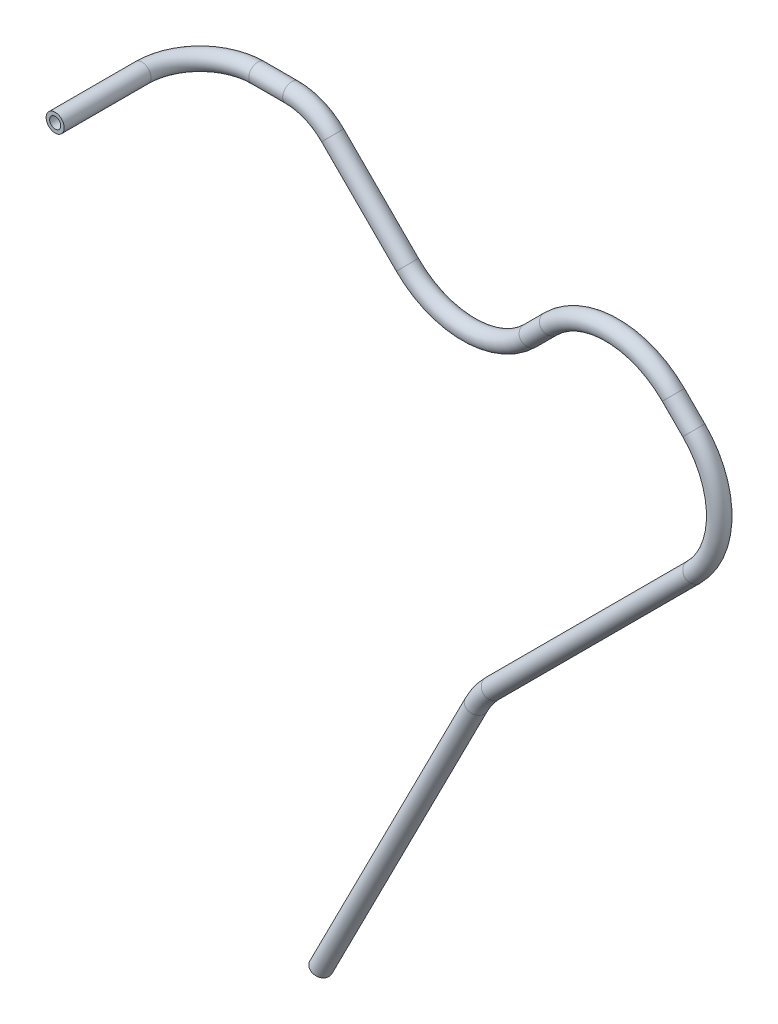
ISO-10303-21;
HEADER;
FILE_DESCRIPTION(('STEP AP214'),'2;1');
FILE_NAME('part.step','',(''),(''),'','','');
FILE_SCHEMA(('AUTOMOTIVE_DESIGN { 1 0 10303 214 1 1 1 1 }'));
ENDSEC;
DATA;
#1=APPLICATION_CONTEXT('core data for automotive mechanical design processes');
#2=APPLICATION_PROTOCOL_DEFINITION('international standard','automotive_design',2000,#1);
#3=PRODUCT_CONTEXT('',#1,'mechanical');
#4=PRODUCT('Part','Part','',(#3));
#5=PRODUCT_RELATED_PRODUCT_CATEGORY('part','',(#4));
#6=PRODUCT_DEFINITION_FORMATION('','',#4);
#7=PRODUCT_DEFINITION_CONTEXT('part definition',#1,'design');
#8=PRODUCT_DEFINITION('design','',#6,#7);
#9=PRODUCT_DEFINITION_SHAPE('','',#8);
#10=(LENGTH_UNIT() NAMED_UNIT(*) SI_UNIT(.MILLI.,.METRE.));
#11=(NAMED_UNIT(*) PLANE_ANGLE_UNIT() SI_UNIT($,.RADIAN.));
#12=(NAMED_UNIT(*) SI_UNIT($,.STERADIAN.) SOLID_ANGLE_UNIT());
#13=UNCERTAINTY_MEASURE_WITH_UNIT(LENGTH_MEASURE(1.E-05),#10,'distance_accuracy_value','');
#14=(GEOMETRIC_REPRESENTATION_CONTEXT(3) GLOBAL_UNCERTAINTY_ASSIGNED_CONTEXT((#13)) GLOBAL_UNIT_ASSIGNED_CONTEXT((#10,
#11,#12)) REPRESENTATION_CONTEXT('',''));
#15=CARTESIAN_POINT('',(0.,0.,0.));
#16=DIRECTION('',(0.,0.,1.));
#17=DIRECTION('',(1.,0.,0.));
#18=AXIS2_PLACEMENT_3D('',#15,#16,#17);
#19=CARTESIAN_POINT('',(0.,0.,0.));
#20=DIRECTION('',(0.,0.,-1.));
#21=DIRECTION('',(-1.,0.,0.));
#22=AXIS2_PLACEMENT_3D('',#19,#20,#21);
#23=CYLINDRICAL_SURFACE('',#22,7.9375);
#24=CARTESIAN_POINT('',(0.,0.,-76.2));
#25=DIRECTION('',(0.,0.,1.));
#26=DIRECTION('',(1.,0.,0.));
#27=AXIS2_PLACEMENT_3D('',#24,#25,#26);
#28=CIRCLE('',#27,7.9375);
#29=CARTESIAN_POINT('',(-7.9375,0.,-76.2));
#30=VERTEX_POINT('',#29);
#31=EDGE_CURVE('E172',#30,#30,#28,.T.);
#32=ORIENTED_EDGE('',*,*,#31,.T.);
#33=EDGE_LOOP('',(#32));
#34=FACE_BOUND('',#33,.T.);
#35=CARTESIAN_POINT('',(0.,0.,0.));
#36=DIRECTION('',(0.,0.,1.));
#37=DIRECTION('',(1.,0.,0.));
#38=AXIS2_PLACEMENT_3D('',#35,#36,#37);
#39=CIRCLE('',#38,7.9375);
#40=CARTESIAN_POINT('',(7.9375,0.,0.));
#41=VERTEX_POINT('',#40);
#42=EDGE_CURVE('E50',#41,#41,#39,.T.);
#43=ORIENTED_EDGE('',*,*,#42,.F.);
#44=EDGE_LOOP('',(#43));
#45=FACE_BOUND('',#44,.T.);
#46=ADVANCED_FACE('F35',(#34,#45),#23,.T.);
#47=CARTESIAN_POINT('',(50.8,0.,-76.2));
#48=DIRECTION('',(0.,-1.,0.));
#49=DIRECTION('',(0.,0.,-1.));
#50=AXIS2_PLACEMENT_3D('',#47,#48,#49);
#51=TOROIDAL_SURFACE('',#50,50.8,7.9375);
#52=CARTESIAN_POINT('',(50.8,0.,-127.));
#53=DIRECTION('',(-1.,0.,0.));
#54=DIRECTION('',(0.,0.,1.));
#55=AXIS2_PLACEMENT_3D('',#52,#53,#54);
#56=CIRCLE('',#55,7.9375);
#57=CARTESIAN_POINT('',(50.8,0.,-134.9375));
#58=VERTEX_POINT('',#57);
#59=EDGE_CURVE('E175',#58,#58,#56,.T.);
#60=CARTESIAN_POINT('',(50.8,0.,-76.2));
#61=DIRECTION('',(0.,-1.,0.));
#62=DIRECTION('',(0.,0.,-1.));
#63=AXIS2_PLACEMENT_3D('',#60,#61,#62);
#64=CIRCLE('',#63,58.7375);
#65=EDGE_CURVE('',#30,#58,#64,.T.);
#66=ORIENTED_EDGE('',*,*,#31,.F.);
#67=ORIENTED_EDGE('',*,*,#59,.T.);
#68=ORIENTED_EDGE('',*,*,#65,.T.);
#69=ORIENTED_EDGE('',*,*,#65,.F.);
#70=EDGE_LOOP('',(#66,#68,#67,#69));
#71=FACE_BOUND('',#70,.T.);
#72=ADVANCED_FACE('F253',(#71),#51,.T.);
#73=CARTESIAN_POINT('',(50.8,0.,-127.));
#74=DIRECTION('',(1.,0.,0.));
#75=DIRECTION('',(0.,0.,-1.));
#76=AXIS2_PLACEMENT_3D('',#73,#74,#75);
#77=CYLINDRICAL_SURFACE('',#76,7.9375);
#78=CARTESIAN_POINT('',(80.5579510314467,0.,-127.));
#79=DIRECTION('',(-1.,0.,0.));
#80=DIRECTION('',(0.,0.,1.));
#81=AXIS2_PLACEMENT_3D('',#78,#79,#80);
#82=CIRCLE('',#81,7.9375);
#83=CARTESIAN_POINT('',(80.5579510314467,7.9375,-126.999999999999));
#84=VERTEX_POINT('',#83);
#85=EDGE_CURVE('E178',#84,#84,#82,.T.);
#86=ORIENTED_EDGE('',*,*,#85,.T.);
#87=EDGE_LOOP('',(#86));
#88=FACE_BOUND('',#87,.T.);
#89=ORIENTED_EDGE('',*,*,#59,.F.);
#90=EDGE_LOOP('',(#89));
#91=FACE_BOUND('',#90,.T.);
#92=ADVANCED_FACE('F249',(#88,#91),#77,.T.);
#93=CARTESIAN_POINT('',(80.5579510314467,-50.8,-127.000000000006));
#94=DIRECTION('',(0.,1.23752714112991E-13,-1.));
#95=DIRECTION('',(0.,1.,1.23752714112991E-13));
#96=AXIS2_PLACEMENT_3D('',#93,#94,#95);
#97=TOROIDAL_SURFACE('',#96,50.8,7.9375);
#98=CARTESIAN_POINT('',(116.478975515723,-14.8789755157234,-127.000000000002));
#99=DIRECTION('',(-0.707106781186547,0.707106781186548,0.));
#100=DIRECTION('',(0.,0.,1.));
#101=AXIS2_PLACEMENT_3D('',#98,#99,#100);
#102=CIRCLE('',#101,7.9375);
#103=CARTESIAN_POINT('',(122.091635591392,-9.26631544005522,-127.000000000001));
#104=VERTEX_POINT('',#103);
#105=EDGE_CURVE('E181',#104,#104,#102,.T.);
#106=CARTESIAN_POINT('',(80.5579510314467,-50.8,-127.000000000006));
#107=DIRECTION('',(0.,1.23752714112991E-13,-1.));
#108=DIRECTION('',(0.,1.,1.23752714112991E-13));
#109=AXIS2_PLACEMENT_3D('',#106,#107,#108);
#110=CIRCLE('',#109,58.7375);
#111=EDGE_CURVE('',#84,#104,#110,.T.);
#112=ORIENTED_EDGE('',*,*,#85,.F.);
#113=ORIENTED_EDGE('',*,*,#105,.T.);
#114=ORIENTED_EDGE('',*,*,#111,.T.);
#115=ORIENTED_EDGE('',*,*,#111,.F.);
#116=EDGE_LOOP('',(#112,#114,#113,#115));
#117=FACE_BOUND('',#116,.T.);
#118=ADVANCED_FACE('F245',(#117),#97,.T.);
#119=CARTESIAN_POINT('',(116.478975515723,-14.8789755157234,-127.000000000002));
#120=DIRECTION('',(0.707106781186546,-0.707106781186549,0.));
#121=DIRECTION('',(0.707106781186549,0.707106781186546,0.));
#122=AXIS2_PLACEMENT_3D('',#119,#120,#121);
#123=CYLINDRICAL_SURFACE('',#122,7.9375);
#124=CARTESIAN_POINT('',(182.05836842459,-80.4583684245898,-127.00000000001));
#125=DIRECTION('',(-0.707106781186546,0.707106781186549,0.));
#126=DIRECTION('',(0.,0.,1.));
#127=AXIS2_PLACEMENT_3D('',#124,#125,#126);
#128=CIRCLE('',#127,7.9375);
#129=CARTESIAN_POINT('',(176.445708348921,-86.071028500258,-127.00000000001));
#130=VERTEX_POINT('',#129);
#131=EDGE_CURVE('E184',#130,#130,#128,.T.);
#132=ORIENTED_EDGE('',*,*,#131,.T.);
#133=EDGE_LOOP('',(#132));
#134=FACE_BOUND('',#133,.T.);
#135=ORIENTED_EDGE('',*,*,#105,.F.);
#136=EDGE_LOOP('',(#135));
#137=FACE_BOUND('',#136,.T.);
#138=ADVANCED_FACE('F241',(#134,#137),#123,.T.);
#139=CARTESIAN_POINT('',(235.939905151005,-26.576831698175,-127.00000000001));
#140=DIRECTION('',(0.,0.,1.));
#141=DIRECTION('',(1.,0.,0.));
#142=AXIS2_PLACEMENT_3D('',#139,#140,#141);
#143=TOROIDAL_SURFACE('',#142,76.2,7.9375);
#144=CARTESIAN_POINT('',(289.82144187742,-80.4583684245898,-127.000000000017));
#145=DIRECTION('',(-0.707106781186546,-0.707106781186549,0.));
#146=DIRECTION('',(0.,0.,1.));
#147=AXIS2_PLACEMENT_3D('',#144,#145,#146);
#148=CIRCLE('',#147,7.9375);
#149=CARTESIAN_POINT('',(295.434101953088,-86.0710285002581,-127.000000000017));
#150=VERTEX_POINT('',#149);
#151=EDGE_CURVE('E187',#150,#150,#148,.T.);
#152=CARTESIAN_POINT('',(235.939905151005,-26.576831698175,-127.00000000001));
#153=DIRECTION('',(0.,0.,1.));
#154=DIRECTION('',(1.,0.,0.));
#155=AXIS2_PLACEMENT_3D('',#152,#153,#154);
#156=CIRCLE('',#155,84.1375);
#157=EDGE_CURVE('',#130,#150,#156,.T.);
#158=ORIENTED_EDGE('',*,*,#131,.F.);
#159=ORIENTED_EDGE('',*,*,#151,.T.);
#160=ORIENTED_EDGE('',*,*,#157,.T.);
#161=ORIENTED_EDGE('',*,*,#157,.F.);
#162=EDGE_LOOP('',(#158,#160,#159,#161));
#163=FACE_BOUND('',#162,.T.);
#164=ADVANCED_FACE('F237',(#163),#143,.T.);
#165=CARTESIAN_POINT('',(289.82144187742,-80.4583684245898,-127.000000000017));
#166=DIRECTION('',(0.707106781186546,0.707106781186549,0.));
#167=DIRECTION('',(-0.707106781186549,0.707106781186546,0.));
#168=AXIS2_PLACEMENT_3D('',#165,#166,#167);
#169=CYLINDRICAL_SURFACE('',#168,7.9375);
#170=CARTESIAN_POINT('',(307.667394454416,-62.6124158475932,-127.000000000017));
#171=DIRECTION('',(-0.707106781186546,-0.707106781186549,0.));
#172=DIRECTION('',(0.,0.,1.));
#173=AXIS2_PLACEMENT_3D('',#170,#171,#172);
#174=CIRCLE('',#173,7.9375);
#175=CARTESIAN_POINT('',(302.054734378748,-56.999755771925,-127.000000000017));
#176=VERTEX_POINT('',#175);
#177=EDGE_CURVE('E190',#176,#176,#174,.T.);
#178=ORIENTED_EDGE('',*,*,#177,.T.);
#179=EDGE_LOOP('',(#178));
#180=FACE_BOUND('',#179,.T.);
#181=ORIENTED_EDGE('',*,*,#151,.F.);
#182=EDGE_LOOP('',(#181));
#183=FACE_BOUND('',#182,.T.);
#184=ADVANCED_FACE('F233',(#180,#183),#169,.T.);
#185=CARTESIAN_POINT('',(361.548931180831,-116.493952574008,-127.000000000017));
#186=DIRECTION('',(0.,0.,-1.));
#187=DIRECTION('',(-1.,0.,0.));
#188=AXIS2_PLACEMENT_3D('',#185,#186,#187);
#189=TOROIDAL_SURFACE('',#188,76.2,7.9375);
#190=CARTESIAN_POINT('',(415.430467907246,-62.6124158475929,-127.000000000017));
#191=DIRECTION('',(-0.707106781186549,0.707106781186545,0.));
#192=DIRECTION('',(0.,0.,1.));
#193=AXIS2_PLACEMENT_3D('',#190,#191,#192);
#194=CIRCLE('',#193,7.9375);
#195=CARTESIAN_POINT('',(421.043127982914,-56.9997557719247,-127.000000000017));
#196=VERTEX_POINT('',#195);
#197=EDGE_CURVE('E193',#196,#196,#194,.T.);
#198=CARTESIAN_POINT('',(361.548931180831,-116.493952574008,-127.000000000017));
#199=DIRECTION('',(0.,0.,-1.));
#200=DIRECTION('',(-1.,0.,0.));
#201=AXIS2_PLACEMENT_3D('',#198,#199,#200);
#202=CIRCLE('',#201,84.1375);
#203=EDGE_CURVE('',#176,#196,#202,.T.);
#204=ORIENTED_EDGE('',*,*,#177,.F.);
#205=ORIENTED_EDGE('',*,*,#197,.T.);
#206=ORIENTED_EDGE('',*,*,#203,.T.);
#207=ORIENTED_EDGE('',*,*,#203,.F.);
#208=EDGE_LOOP('',(#204,#206,#205,#207));
#209=FACE_BOUND('',#208,.T.);
#210=ADVANCED_FACE('F229',(#209),#189,.T.);
#211=CARTESIAN_POINT('',(415.430467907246,-62.612415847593,-127.000000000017));
#212=DIRECTION('',(0.707106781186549,-0.707106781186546,0.));
#213=DIRECTION('',(0.707106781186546,0.707106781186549,0.));
#214=AXIS2_PLACEMENT_3D('',#211,#212,#213);
#215=CYLINDRICAL_SURFACE('',#214,7.9375);
#216=CARTESIAN_POINT('',(433.390980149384,-80.5729280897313,-127.000000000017));
#217=DIRECTION('',(-0.707106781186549,0.707106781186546,0.));
#218=DIRECTION('',(0.,0.,1.));
#219=AXIS2_PLACEMENT_3D('',#216,#217,#218);
#220=CIRCLE('',#219,7.9375);
#221=CARTESIAN_POINT('',(439.003640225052,-74.960268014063,-127.000000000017));
#222=VERTEX_POINT('',#221);
#223=EDGE_CURVE('E196',#222,#222,#220,.T.);
#224=CARTESIAN_POINT('',(439.003640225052,-74.960268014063,-127.000000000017));
#225=CARTESIAN_POINT('',(438.816551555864,-74.7731793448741,-127.000000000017));
#226=CARTESIAN_POINT('',(438.629462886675,-74.5860906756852,-127.000000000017));
#227=CARTESIAN_POINT('',(438.255285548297,-74.2119133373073,-127.000000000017));
#228=CARTESIAN_POINT('',(438.068196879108,-74.0248246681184,-127.000000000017));
#229=CARTESIAN_POINT('',(437.69401954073,-73.6506473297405,-127.000000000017));
#230=CARTESIAN_POINT('',(437.506930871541,-73.4635586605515,-127.000000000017));
#231=CARTESIAN_POINT('',(437.132753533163,-73.0893813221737,-127.000000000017));
#232=CARTESIAN_POINT('',(436.945664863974,-72.9022926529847,-127.000000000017));
#233=CARTESIAN_POINT('',(436.571487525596,-72.5281153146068,-127.000000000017));
#234=CARTESIAN_POINT('',(436.384398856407,-72.3410266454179,-127.000000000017));
#235=CARTESIAN_POINT('',(436.010221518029,-71.96684930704,-127.000000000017));
#236=CARTESIAN_POINT('',(435.82313284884,-71.7797606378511,-127.000000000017));
#237=CARTESIAN_POINT('',(435.448955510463,-71.4055832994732,-127.000000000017));
#238=CARTESIAN_POINT('',(435.261866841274,-71.2184946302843,-127.000000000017));
#239=CARTESIAN_POINT('',(434.887689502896,-70.8443172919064,-127.000000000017));
#240=CARTESIAN_POINT('',(434.700600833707,-70.6572286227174,-127.000000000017));
#241=CARTESIAN_POINT('',(434.326423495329,-70.2830512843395,-127.000000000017));
#242=CARTESIAN_POINT('',(434.13933482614,-70.0959626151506,-127.000000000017));
#243=CARTESIAN_POINT('',(433.765157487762,-69.7217852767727,-127.000000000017));
#244=CARTESIAN_POINT('',(433.578068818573,-69.5346966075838,-127.000000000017));
#245=CARTESIAN_POINT('',(433.203891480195,-69.1605192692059,-127.000000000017));
#246=CARTESIAN_POINT('',(433.016802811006,-68.9734306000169,-127.000000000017));
#247=CARTESIAN_POINT('',(432.642625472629,-68.5992532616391,-127.000000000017));
#248=CARTESIAN_POINT('',(432.45553680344,-68.4121645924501,-127.000000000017));
#249=CARTESIAN_POINT('',(432.081359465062,-68.0379872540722,-127.000000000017));
#250=CARTESIAN_POINT('',(431.894270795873,-67.8508985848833,-127.000000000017));
#251=CARTESIAN_POINT('',(431.520093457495,-67.4767212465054,-127.000000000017));
#252=CARTESIAN_POINT('',(431.333004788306,-67.2896325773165,-127.000000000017));
#253=CARTESIAN_POINT('',(430.958827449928,-66.9154552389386,-127.000000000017));
#254=CARTESIAN_POINT('',(430.771738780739,-66.7283665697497,-127.000000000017));
#255=CARTESIAN_POINT('',(430.397561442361,-66.3541892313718,-127.000000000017));
#256=CARTESIAN_POINT('',(430.210472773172,-66.1671005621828,-127.000000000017));
#257=CARTESIAN_POINT('',(429.836295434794,-65.7929232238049,-127.000000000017));
#258=CARTESIAN_POINT('',(429.649206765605,-65.605834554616,-127.000000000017));
#259=CARTESIAN_POINT('',(429.275029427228,-65.2316572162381,-127.000000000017));
#260=CARTESIAN_POINT('',(429.087940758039,-65.0445685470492,-127.000000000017));
#261=CARTESIAN_POINT('',(428.713763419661,-64.6703912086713,-127.000000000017));
#262=CARTESIAN_POINT('',(428.526674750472,-64.4833025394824,-127.000000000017));
#263=CARTESIAN_POINT('',(428.152497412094,-64.1091252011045,-127.000000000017));
#264=CARTESIAN_POINT('',(427.965408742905,-63.9220365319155,-127.000000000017));
#265=CARTESIAN_POINT('',(427.591231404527,-63.5478591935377,-127.000000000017));
#266=CARTESIAN_POINT('',(427.404142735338,-63.3607705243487,-127.000000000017));
#267=CARTESIAN_POINT('',(427.02996539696,-62.9865931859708,-127.000000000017));
#268=CARTESIAN_POINT('',(426.842876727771,-62.7995045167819,-127.000000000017));
#269=CARTESIAN_POINT('',(426.468699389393,-62.425327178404,-127.000000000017));
#270=CARTESIAN_POINT('',(426.281610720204,-62.2382385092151,-127.000000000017));
#271=CARTESIAN_POINT('',(425.907433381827,-61.8640611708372,-127.000000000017));
#272=CARTESIAN_POINT('',(425.720344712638,-61.6769725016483,-127.000000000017));
#273=CARTESIAN_POINT('',(425.34616737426,-61.3027951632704,-127.000000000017));
#274=CARTESIAN_POINT('',(425.159078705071,-61.1157064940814,-127.000000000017));
#275=CARTESIAN_POINT('',(424.784901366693,-60.7415291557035,-127.000000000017));
#276=CARTESIAN_POINT('',(424.597812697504,-60.5544404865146,-127.000000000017));
#277=CARTESIAN_POINT('',(424.223635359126,-60.1802631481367,-127.000000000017));
#278=CARTESIAN_POINT('',(424.036546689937,-59.9931744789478,-127.000000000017));
#279=CARTESIAN_POINT('',(423.662369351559,-59.6189971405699,-127.000000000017));
#280=CARTESIAN_POINT('',(423.47528068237,-59.431908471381,-127.000000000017));
#281=CARTESIAN_POINT('',(423.101103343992,-59.0577311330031,-127.000000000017));
#282=CARTESIAN_POINT('',(422.914014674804,-58.8706424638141,-127.000000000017));
#283=CARTESIAN_POINT('',(422.539837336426,-58.4964651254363,-127.000000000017));
#284=CARTESIAN_POINT('',(422.352748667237,-58.3093764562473,-127.000000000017));
#285=CARTESIAN_POINT('',(421.978571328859,-57.9351991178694,-127.000000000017));
#286=CARTESIAN_POINT('',(421.79148265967,-57.7481104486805,-127.000000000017));
#287=CARTESIAN_POINT('',(421.417305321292,-57.3739331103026,-127.000000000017));
#288=CARTESIAN_POINT('',(421.230216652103,-57.1868444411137,-127.000000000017));
#289=CARTESIAN_POINT('',(421.043127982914,-56.9997557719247,-127.000000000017));
#290=B_SPLINE_CURVE_WITH_KNOTS('',3,(#224,#225,#226,#227,#228,#229,#230,#231,#232,#233,#234,
#235,#236,#237,#238,#239,#240,#241,#242,#243,#244,#245,#246,#247,#248,#249,#250,#251,#252,#253,
#254,#255,#256,#257,#258,#259,#260,#261,#262,#263,#264,#265,#266,#267,#268,#269,#270,#271,#272,
#273,#274,#275,#276,#277,#278,#279,#280,#281,#282,#283,#284,#285,#286,#287,#288,#289),
.UNSPECIFIED.,.F.,.F.,(4,2,2,2,2,2,2,2,2,2,2,2,2,2,2,2,2,2,2,2,2,2,2,2,2,2,2,2,2,2,2,2,4),(0.,
0.793749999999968,1.58749999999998,2.38125,3.17499999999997,3.96874999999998,4.7625,
5.55625000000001,6.34999999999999,7.14375,7.93750000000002,8.73124999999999,9.525,10.31875,
11.1125,11.90625,12.7,13.49375,14.2875,15.08125,15.875,16.66875,17.4625,18.25625,
19.0500000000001,19.84375,20.6375,21.4312500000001,22.2250000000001,23.01875,23.8125000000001,
24.6062500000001,25.4),.UNSPECIFIED.);
#291=EDGE_CURVE('BSEAM225',#222,#196,#290,.T.);
#292=ORIENTED_EDGE('',*,*,#223,.T.);
#293=ORIENTED_EDGE('',*,*,#197,.F.);
#294=ORIENTED_EDGE('',*,*,#291,.T.);
#295=ORIENTED_EDGE('',*,*,#291,.F.);
#296=EDGE_LOOP('',(#292,#294,#293,#295));
#297=FACE_BOUND('',#296,.T.);
#298=ADVANCED_FACE('F225',(#297),#215,.T.);
#299=CARTESIAN_POINT('',(379.509443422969,-134.454464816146,-127.000000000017));
#300=DIRECTION('',(0.,0.,-1.));
#301=DIRECTION('',(-1.,0.,0.));
#302=AXIS2_PLACEMENT_3D('',#299,#300,#301);
#303=TOROIDAL_SURFACE('',#302,76.2,7.9375);
#304=CARTESIAN_POINT('',(433.390980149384,-188.336001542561,-127.000000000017));
#305=DIRECTION('',(0.707106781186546,0.707106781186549,0.));
#306=DIRECTION('',(0.,0.,1.));
#307=AXIS2_PLACEMENT_3D('',#304,#305,#306);
#308=CIRCLE('',#307,7.9375);
#309=CARTESIAN_POINT('',(439.003640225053,-193.948661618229,-127.000000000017));
#310=VERTEX_POINT('',#309);
#311=EDGE_CURVE('E199',#310,#310,#308,.T.);
#312=CARTESIAN_POINT('',(379.509443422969,-134.454464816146,-127.000000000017));
#313=DIRECTION('',(0.,0.,-1.));
#314=DIRECTION('',(-1.,0.,0.));
#315=AXIS2_PLACEMENT_3D('',#312,#313,#314);
#316=CIRCLE('',#315,84.1375);
#317=EDGE_CURVE('',#222,#310,#316,.T.);
#318=ORIENTED_EDGE('',*,*,#223,.F.);
#319=ORIENTED_EDGE('',*,*,#311,.T.);
#320=ORIENTED_EDGE('',*,*,#317,.T.);
#321=ORIENTED_EDGE('',*,*,#317,.F.);
#322=EDGE_LOOP('',(#318,#320,#319,#321));
#323=FACE_BOUND('',#322,.T.);
#324=ADVANCED_FACE('F220',(#323),#303,.T.);
#325=CARTESIAN_POINT('',(433.390980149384,-188.336001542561,-127.000000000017));
#326=DIRECTION('',(-0.707106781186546,-0.707106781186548,0.));
#327=DIRECTION('',(0.707106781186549,-0.707106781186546,0.));
#328=AXIS2_PLACEMENT_3D('',#325,#326,#327);
#329=CYLINDRICAL_SURFACE('',#328,7.9375);
#330=CARTESIAN_POINT('',(256.577806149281,-365.149175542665,-127.000000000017));
#331=DIRECTION('',(0.707106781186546,0.707106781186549,0.));
#332=DIRECTION('',(0.,0.,1.));
#333=AXIS2_PLACEMENT_3D('',#330,#331,#332);
#334=CIRCLE('',#333,7.9375);
#335=CARTESIAN_POINT('',(250.965146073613,-359.536515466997,-127.000000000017));
#336=VERTEX_POINT('',#335);
#337=EDGE_CURVE('E201',#336,#336,#334,.T.);
#338=ORIENTED_EDGE('',*,*,#337,.T.);
#339=EDGE_LOOP('',(#338));
#340=FACE_BOUND('',#339,.T.);
#341=ORIENTED_EDGE('',*,*,#311,.F.);
#342=EDGE_LOOP('',(#341));
#343=FACE_BOUND('',#342,.T.);
#344=ADVANCED_FACE('F216',(#340,#343),#329,.T.);
#345=CARTESIAN_POINT('',(310.459342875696,-419.03071226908,-127.000000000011));
#346=DIRECTION('',(0.,0.,1.));
#347=DIRECTION('',(1.,0.,0.));
#348=AXIS2_PLACEMENT_3D('',#345,#346,#347);
#349=TOROIDAL_SURFACE('',#348,76.2,7.9375);
#350=CARTESIAN_POINT('',(242.561238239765,-384.443324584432,-127.000000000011));
#351=DIRECTION('',(0.453902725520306,0.891051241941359,0.));
#352=DIRECTION('',(0.,0.,1.));
#353=AXIS2_PLACEMENT_3D('',#350,#351,#352);
#354=CIRCLE('',#353,7.9375);
#355=CARTESIAN_POINT('',(235.488519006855,-380.840471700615,-127.000000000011));
#356=VERTEX_POINT('',#355);
#357=EDGE_CURVE('E39',#356,#356,#354,.T.);
#358=CARTESIAN_POINT('',(310.459342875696,-419.03071226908,-127.000000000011));
#359=DIRECTION('',(0.,0.,1.));
#360=DIRECTION('',(1.,0.,0.));
#361=AXIS2_PLACEMENT_3D('',#358,#359,#360);
#362=CIRCLE('',#361,84.1375);
#363=EDGE_CURVE('',#336,#356,#362,.T.);
#364=ORIENTED_EDGE('',*,*,#337,.F.);
#365=ORIENTED_EDGE('',*,*,#357,.T.);
#366=ORIENTED_EDGE('',*,*,#363,.T.);
#367=ORIENTED_EDGE('',*,*,#363,.F.);
#368=EDGE_LOOP('',(#364,#366,#365,#367));
#369=FACE_BOUND('',#368,.T.);
#370=ADVANCED_FACE('F208',(#369),#349,.T.);
#371=CARTESIAN_POINT('',(242.561238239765,-384.443324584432,-127.000000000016));
#372=DIRECTION('',(-0.453902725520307,-0.891051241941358,0.));
#373=DIRECTION('',(0.891051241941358,-0.453902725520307,0.));
#374=AXIS2_PLACEMENT_3D('',#371,#372,#373);
#375=CYLINDRICAL_SURFACE('',#374,7.9375);
#376=CARTESIAN_POINT('',(106.147219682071,-652.236122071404,-127.00000000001));
#377=DIRECTION('',(0.453902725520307,0.891051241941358,0.));
#378=DIRECTION('',(0.,0.,1.));
#379=AXIS2_PLACEMENT_3D('',#376,#377,#378);
#380=CIRCLE('',#379,7.9375);
#381=CARTESIAN_POINT('',(106.147219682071,-652.236122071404,-119.06250000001));
#382=VERTEX_POINT('',#381);
#383=EDGE_CURVE('E55',#382,#382,#380,.T.);
#384=ORIENTED_EDGE('',*,*,#383,.T.);
#385=EDGE_LOOP('',(#384));
#386=FACE_BOUND('',#385,.T.);
#387=ORIENTED_EDGE('',*,*,#357,.F.);
#388=EDGE_LOOP('',(#387));
#389=FACE_BOUND('',#388,.T.);
#390=ADVANCED_FACE('F37',(#386,#389),#375,.T.);
#391=CARTESIAN_POINT('',(0.,0.,0.));
#392=DIRECTION('',(0.,0.,1.));
#393=DIRECTION('',(1.,0.,0.));
#394=AXIS2_PLACEMENT_3D('',#391,#392,#393);
#395=PLANE('',#394);
#396=CARTESIAN_POINT('',(0.,0.,0.));
#397=DIRECTION('',(0.,0.,1.));
#398=DIRECTION('',(1.,0.,0.));
#399=AXIS2_PLACEMENT_3D('',#396,#397,#398);
#400=CIRCLE('',#399,4.8641);
#401=CARTESIAN_POINT('',(4.8641,0.,0.));
#402=VERTEX_POINT('',#401);
#403=EDGE_CURVE('E135',#402,#402,#400,.F.);
#404=ORIENTED_EDGE('',*,*,#403,.T.);
#405=EDGE_LOOP('',(#404));
#406=FACE_BOUND('',#405,.T.);
#407=ORIENTED_EDGE('',*,*,#42,.T.);
#408=EDGE_LOOP('',(#407));
#409=FACE_BOUND('',#408,.T.);
#410=ADVANCED_FACE('F68',(#406,#409),#395,.T.);
#411=CARTESIAN_POINT('',(106.147219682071,-652.236122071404,-127.00000000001));
#412=DIRECTION('',(0.453902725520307,0.891051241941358,0.));
#413=DIRECTION('',(0.,0.,1.));
#414=AXIS2_PLACEMENT_3D('',#411,#412,#413);
#415=PLANE('',#414);
#416=CARTESIAN_POINT('',(106.147219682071,-652.236122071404,-127.00000000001));
#417=DIRECTION('',(0.453902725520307,0.891051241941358,0.));
#418=DIRECTION('',(0.,0.,1.));
#419=AXIS2_PLACEMENT_3D('',#416,#417,#418);
#420=CIRCLE('',#419,4.8641);
#421=CARTESIAN_POINT('',(106.147219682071,-652.236122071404,-122.13590000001));
#422=VERTEX_POINT('',#421);
#423=EDGE_CURVE('E11',#422,#422,#420,.F.);
#424=ORIENTED_EDGE('',*,*,#423,.F.);
#425=EDGE_LOOP('',(#424));
#426=FACE_BOUND('',#425,.T.);
#427=ORIENTED_EDGE('',*,*,#383,.F.);
#428=EDGE_LOOP('',(#427));
#429=FACE_BOUND('',#428,.T.);
#430=ADVANCED_FACE('F65',(#426,#429),#415,.F.);
#431=CARTESIAN_POINT('',(0.,0.,0.));
#432=DIRECTION('',(0.,0.,-1.));
#433=DIRECTION('',(-1.,0.,0.));
#434=AXIS2_PLACEMENT_3D('',#431,#432,#433);
#435=CYLINDRICAL_SURFACE('',#434,4.8641);
#436=CARTESIAN_POINT('',(0.,0.,-76.2));
#437=DIRECTION('',(0.,0.,1.));
#438=DIRECTION('',(1.,0.,0.));
#439=AXIS2_PLACEMENT_3D('',#436,#437,#438);
#440=CIRCLE('',#439,4.8641);
#441=CARTESIAN_POINT('',(-4.8641,0.,-76.2));
#442=VERTEX_POINT('',#441);
#443=EDGE_CURVE('E134',#442,#442,#440,.F.);
#444=ORIENTED_EDGE('',*,*,#443,.T.);
#445=EDGE_LOOP('',(#444));
#446=FACE_BOUND('',#445,.T.);
#447=ORIENTED_EDGE('',*,*,#403,.F.);
#448=EDGE_LOOP('',(#447));
#449=FACE_BOUND('',#448,.T.);
#450=ADVANCED_FACE('F67',(#446,#449),#435,.F.);
#451=CARTESIAN_POINT('',(50.8,0.,-76.2));
#452=DIRECTION('',(0.,-1.,0.));
#453=DIRECTION('',(0.,0.,-1.));
#454=AXIS2_PLACEMENT_3D('',#451,#452,#453);
#455=TOROIDAL_SURFACE('',#454,50.8,4.8641);
#456=CARTESIAN_POINT('',(50.8,0.,-127.));
#457=DIRECTION('',(-1.,0.,0.));
#458=DIRECTION('',(0.,0.,1.));
#459=AXIS2_PLACEMENT_3D('',#456,#457,#458);
#460=CIRCLE('',#459,4.8641);
#461=CARTESIAN_POINT('',(50.8,0.,-131.8641));
#462=VERTEX_POINT('',#461);
#463=EDGE_CURVE('E131',#462,#462,#460,.F.);
#464=CARTESIAN_POINT('',(50.8,0.,-76.2));
#465=DIRECTION('',(0.,-1.,0.));
#466=DIRECTION('',(0.,0.,-1.));
#467=AXIS2_PLACEMENT_3D('',#464,#465,#466);
#468=CIRCLE('',#467,55.6641);
#469=EDGE_CURVE('',#442,#462,#468,.T.);
#470=ORIENTED_EDGE('',*,*,#443,.F.);
#471=ORIENTED_EDGE('',*,*,#463,.T.);
#472=ORIENTED_EDGE('',*,*,#469,.T.);
#473=ORIENTED_EDGE('',*,*,#469,.F.);
#474=EDGE_LOOP('',(#470,#472,#471,#473));
#475=FACE_BOUND('',#474,.T.);
#476=ADVANCED_FACE('F74',(#475),#455,.F.);
#477=CARTESIAN_POINT('',(50.8,0.,-127.));
#478=DIRECTION('',(1.,0.,0.));
#479=DIRECTION('',(0.,0.,-1.));
#480=AXIS2_PLACEMENT_3D('',#477,#478,#479);
#481=CYLINDRICAL_SURFACE('',#480,4.8641);
#482=CARTESIAN_POINT('',(80.5579510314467,0.,-127.));
#483=DIRECTION('',(-1.,0.,0.));
#484=DIRECTION('',(0.,0.,1.));
#485=AXIS2_PLACEMENT_3D('',#482,#483,#484);
#486=CIRCLE('',#485,4.8641);
#487=CARTESIAN_POINT('',(80.5579510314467,4.8641,-126.999999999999));
#488=VERTEX_POINT('',#487);
#489=EDGE_CURVE('E137',#488,#488,#486,.F.);
#490=ORIENTED_EDGE('',*,*,#489,.T.);
#491=EDGE_LOOP('',(#490));
#492=FACE_BOUND('',#491,.T.);
#493=ORIENTED_EDGE('',*,*,#463,.F.);
#494=EDGE_LOOP('',(#493));
#495=FACE_BOUND('',#494,.T.);
#496=ADVANCED_FACE('F119',(#492,#495),#481,.F.);
#497=CARTESIAN_POINT('',(80.5579510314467,-50.8,-127.000000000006));
#498=DIRECTION('',(0.,1.23752714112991E-13,-1.));
#499=DIRECTION('',(0.,1.,1.23752714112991E-13));
#500=AXIS2_PLACEMENT_3D('',#497,#498,#499);
#501=TOROIDAL_SURFACE('',#500,50.8,4.8641);
#502=CARTESIAN_POINT('',(116.478975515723,-14.8789755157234,-127.000000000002));
#503=DIRECTION('',(-0.707106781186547,0.707106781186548,0.));
#504=DIRECTION('',(0.,0.,1.));
#505=AXIS2_PLACEMENT_3D('',#502,#503,#504);
#506=CIRCLE('',#505,4.8641);
#507=CARTESIAN_POINT('',(119.918413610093,-11.439537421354,-127.000000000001));
#508=VERTEX_POINT('',#507);
#509=EDGE_CURVE('E144',#508,#508,#506,.F.);
#510=CARTESIAN_POINT('',(80.5579510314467,-50.8,-127.000000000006));
#511=DIRECTION('',(0.,1.23752714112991E-13,-1.));
#512=DIRECTION('',(0.,1.,1.23752714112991E-13));
#513=AXIS2_PLACEMENT_3D('',#510,#511,#512);
#514=CIRCLE('',#513,55.6641);
#515=EDGE_CURVE('',#488,#508,#514,.T.);
#516=ORIENTED_EDGE('',*,*,#489,.F.);
#517=ORIENTED_EDGE('',*,*,#509,.T.);
#518=ORIENTED_EDGE('',*,*,#515,.T.);
#519=ORIENTED_EDGE('',*,*,#515,.F.);
#520=EDGE_LOOP('',(#516,#518,#517,#519));
#521=FACE_BOUND('',#520,.T.);
#522=ADVANCED_FACE('F115',(#521),#501,.F.);
#523=CARTESIAN_POINT('',(116.478975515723,-14.8789755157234,-127.000000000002));
#524=DIRECTION('',(0.707106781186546,-0.707106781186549,0.));
#525=DIRECTION('',(0.707106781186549,0.707106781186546,0.));
#526=AXIS2_PLACEMENT_3D('',#523,#524,#525);
#527=CYLINDRICAL_SURFACE('',#526,4.8641);
#528=CARTESIAN_POINT('',(182.05836842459,-80.4583684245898,-127.00000000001));
#529=DIRECTION('',(-0.707106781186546,0.707106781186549,0.));
#530=DIRECTION('',(0.,0.,1.));
#531=AXIS2_PLACEMENT_3D('',#528,#529,#530);
#532=CIRCLE('',#531,4.8641);
#533=CARTESIAN_POINT('',(178.61893033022,-83.8978065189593,-127.00000000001));
#534=VERTEX_POINT('',#533);
#535=EDGE_CURVE('E147',#534,#534,#532,.F.);
#536=ORIENTED_EDGE('',*,*,#535,.T.);
#537=EDGE_LOOP('',(#536));
#538=FACE_BOUND('',#537,.T.);
#539=ORIENTED_EDGE('',*,*,#509,.F.);
#540=EDGE_LOOP('',(#539));
#541=FACE_BOUND('',#540,.T.);
#542=ADVANCED_FACE('F111',(#538,#541),#527,.F.);
#543=CARTESIAN_POINT('',(235.939905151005,-26.576831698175,-127.00000000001));
#544=DIRECTION('',(0.,0.,1.));
#545=DIRECTION('',(1.,0.,0.));
#546=AXIS2_PLACEMENT_3D('',#543,#544,#545);
#547=TOROIDAL_SURFACE('',#546,76.2,4.8641);
#548=CARTESIAN_POINT('',(289.82144187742,-80.4583684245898,-127.000000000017));
#549=DIRECTION('',(-0.707106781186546,-0.707106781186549,0.));
#550=DIRECTION('',(0.,0.,1.));
#551=AXIS2_PLACEMENT_3D('',#548,#549,#550);
#552=CIRCLE('',#551,4.8641);
#553=CARTESIAN_POINT('',(293.260879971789,-83.8978065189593,-127.000000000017));
#554=VERTEX_POINT('',#553);
#555=EDGE_CURVE('E150',#554,#554,#552,.F.);
#556=CARTESIAN_POINT('',(235.939905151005,-26.576831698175,-127.00000000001));
#557=DIRECTION('',(0.,0.,1.));
#558=DIRECTION('',(1.,0.,0.));
#559=AXIS2_PLACEMENT_3D('',#556,#557,#558);
#560=CIRCLE('',#559,81.0641);
#561=EDGE_CURVE('',#534,#554,#560,.T.);
#562=ORIENTED_EDGE('',*,*,#535,.F.);
#563=ORIENTED_EDGE('',*,*,#555,.T.);
#564=ORIENTED_EDGE('',*,*,#561,.T.);
#565=ORIENTED_EDGE('',*,*,#561,.F.);
#566=EDGE_LOOP('',(#562,#564,#563,#565));
#567=FACE_BOUND('',#566,.T.);
#568=ADVANCED_FACE('F107',(#567),#547,.F.);
#569=CARTESIAN_POINT('',(289.82144187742,-80.4583684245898,-127.000000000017));
#570=DIRECTION('',(0.707106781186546,0.707106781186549,0.));
#571=DIRECTION('',(-0.707106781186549,0.707106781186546,0.));
#572=AXIS2_PLACEMENT_3D('',#569,#570,#571);
#573=CYLINDRICAL_SURFACE('',#572,4.8641);
#574=CARTESIAN_POINT('',(307.667394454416,-62.6124158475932,-127.000000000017));
#575=DIRECTION('',(-0.707106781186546,-0.707106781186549,0.));
#576=DIRECTION('',(0.,0.,1.));
#577=AXIS2_PLACEMENT_3D('',#574,#575,#576);
#578=CIRCLE('',#577,4.8641);
#579=CARTESIAN_POINT('',(304.227956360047,-59.1729777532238,-127.000000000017));
#580=VERTEX_POINT('',#579);
#581=EDGE_CURVE('E153',#580,#580,#578,.F.);
#582=ORIENTED_EDGE('',*,*,#581,.T.);
#583=EDGE_LOOP('',(#582));
#584=FACE_BOUND('',#583,.T.);
#585=ORIENTED_EDGE('',*,*,#555,.F.);
#586=EDGE_LOOP('',(#585));
#587=FACE_BOUND('',#586,.T.);
#588=ADVANCED_FACE('F103',(#584,#587),#573,.F.);
#589=CARTESIAN_POINT('',(361.548931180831,-116.493952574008,-127.000000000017));
#590=DIRECTION('',(0.,0.,-1.));
#591=DIRECTION('',(-1.,0.,0.));
#592=AXIS2_PLACEMENT_3D('',#589,#590,#591);
#593=TOROIDAL_SURFACE('',#592,76.2,4.8641);
#594=CARTESIAN_POINT('',(415.430467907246,-62.6124158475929,-127.000000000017));
#595=DIRECTION('',(-0.707106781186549,0.707106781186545,0.));
#596=DIRECTION('',(0.,0.,1.));
#597=AXIS2_PLACEMENT_3D('',#594,#595,#596);
#598=CIRCLE('',#597,4.8641);
#599=CARTESIAN_POINT('',(418.869906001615,-59.1729777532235,-127.000000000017));
#600=VERTEX_POINT('',#599);
#601=EDGE_CURVE('E156',#600,#600,#598,.F.);
#602=CARTESIAN_POINT('',(361.548931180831,-116.493952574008,-127.000000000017));
#603=DIRECTION('',(0.,0.,-1.));
#604=DIRECTION('',(-1.,0.,0.));
#605=AXIS2_PLACEMENT_3D('',#602,#603,#604);
#606=CIRCLE('',#605,81.0641);
#607=EDGE_CURVE('',#580,#600,#606,.T.);
#608=ORIENTED_EDGE('',*,*,#581,.F.);
#609=ORIENTED_EDGE('',*,*,#601,.T.);
#610=ORIENTED_EDGE('',*,*,#607,.T.);
#611=ORIENTED_EDGE('',*,*,#607,.F.);
#612=EDGE_LOOP('',(#608,#610,#609,#611));
#613=FACE_BOUND('',#612,.T.);
#614=ADVANCED_FACE('F99',(#613),#593,.F.);
#615=CARTESIAN_POINT('',(415.430467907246,-62.612415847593,-127.000000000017));
#616=DIRECTION('',(0.707106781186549,-0.707106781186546,0.));
#617=DIRECTION('',(0.707106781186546,0.707106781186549,0.));
#618=AXIS2_PLACEMENT_3D('',#615,#616,#617);
#619=CYLINDRICAL_SURFACE('',#618,4.8641);
#620=CARTESIAN_POINT('',(433.390980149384,-80.5729280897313,-127.000000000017));
#621=DIRECTION('',(-0.707106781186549,0.707106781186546,0.));
#622=DIRECTION('',(0.,0.,1.));
#623=AXIS2_PLACEMENT_3D('',#620,#621,#622);
#624=CIRCLE('',#623,4.8641);
#625=CARTESIAN_POINT('',(436.830418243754,-77.1334899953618,-127.000000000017));
#626=VERTEX_POINT('',#625);
#627=EDGE_CURVE('E159',#626,#626,#624,.F.);
#628=CARTESIAN_POINT('',(436.830418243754,-77.1334899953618,-127.000000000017));
#629=CARTESIAN_POINT('',(436.643329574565,-76.9464013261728,-127.000000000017));
#630=CARTESIAN_POINT('',(436.456240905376,-76.7593126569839,-127.000000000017));
#631=CARTESIAN_POINT('',(436.082063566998,-76.385135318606,-127.000000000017));
#632=CARTESIAN_POINT('',(435.894974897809,-76.1980466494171,-127.000000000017));
#633=CARTESIAN_POINT('',(435.520797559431,-75.8238693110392,-127.000000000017));
#634=CARTESIAN_POINT('',(435.333708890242,-75.6367806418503,-127.000000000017));
#635=CARTESIAN_POINT('',(434.959531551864,-75.2626033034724,-127.000000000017));
#636=CARTESIAN_POINT('',(434.772442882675,-75.0755146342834,-127.000000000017));
#637=CARTESIAN_POINT('',(434.398265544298,-74.7013372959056,-127.000000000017));
#638=CARTESIAN_POINT('',(434.211176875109,-74.5142486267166,-127.000000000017));
#639=CARTESIAN_POINT('',(433.836999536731,-74.1400712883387,-127.000000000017));
#640=CARTESIAN_POINT('',(433.649910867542,-73.9529826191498,-127.000000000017));
#641=CARTESIAN_POINT('',(433.275733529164,-73.5788052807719,-127.000000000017));
#642=CARTESIAN_POINT('',(433.088644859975,-73.391716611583,-127.000000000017));
#643=CARTESIAN_POINT('',(432.714467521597,-73.0175392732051,-127.000000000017));
#644=CARTESIAN_POINT('',(432.527378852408,-72.8304506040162,-127.000000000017));
#645=CARTESIAN_POINT('',(432.15320151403,-72.4562732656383,-127.000000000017));
#646=CARTESIAN_POINT('',(431.966112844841,-72.2691845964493,-127.000000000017));
#647=CARTESIAN_POINT('',(431.591935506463,-71.8950072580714,-127.000000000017));
#648=CARTESIAN_POINT('',(431.404846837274,-71.7079185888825,-127.000000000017));
#649=CARTESIAN_POINT('',(431.030669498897,-71.3337412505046,-127.000000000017));
#650=CARTESIAN_POINT('',(430.843580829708,-71.1466525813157,-127.000000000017));
#651=CARTESIAN_POINT('',(430.46940349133,-70.7724752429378,-127.000000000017));
#652=CARTESIAN_POINT('',(430.282314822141,-70.5853865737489,-127.000000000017));
#653=CARTESIAN_POINT('',(429.908137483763,-70.211209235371,-127.000000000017));
#654=CARTESIAN_POINT('',(429.721048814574,-70.024120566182,-127.000000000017));
#655=CARTESIAN_POINT('',(429.346871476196,-69.6499432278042,-127.000000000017));
#656=CARTESIAN_POINT('',(429.159782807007,-69.4628545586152,-127.000000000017));
#657=CARTESIAN_POINT('',(428.785605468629,-69.0886772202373,-127.000000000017));
#658=CARTESIAN_POINT('',(428.59851679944,-68.9015885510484,-127.000000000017));
#659=CARTESIAN_POINT('',(428.224339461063,-68.5274112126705,-127.000000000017));
#660=CARTESIAN_POINT('',(428.037250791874,-68.3403225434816,-127.000000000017));
#661=CARTESIAN_POINT('',(427.663073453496,-67.9661452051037,-127.000000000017));
#662=CARTESIAN_POINT('',(427.475984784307,-67.7790565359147,-127.000000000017));
#663=CARTESIAN_POINT('',(427.101807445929,-67.4048791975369,-127.000000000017));
#664=CARTESIAN_POINT('',(426.91471877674,-67.2177905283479,-127.000000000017));
#665=CARTESIAN_POINT('',(426.540541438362,-66.84361318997,-127.000000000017));
#666=CARTESIAN_POINT('',(426.353452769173,-66.6565245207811,-127.000000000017));
#667=CARTESIAN_POINT('',(425.979275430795,-66.2823471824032,-127.000000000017));
#668=CARTESIAN_POINT('',(425.792186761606,-66.0952585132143,-127.000000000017));
#669=CARTESIAN_POINT('',(425.418009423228,-65.7210811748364,-127.000000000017));
#670=CARTESIAN_POINT('',(425.230920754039,-65.5339925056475,-127.000000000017));
#671=CARTESIAN_POINT('',(424.856743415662,-65.1598151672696,-127.000000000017));
#672=CARTESIAN_POINT('',(424.669654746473,-64.9727264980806,-127.000000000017));
#673=CARTESIAN_POINT('',(424.295477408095,-64.5985491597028,-127.000000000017));
#674=CARTESIAN_POINT('',(424.108388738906,-64.4114604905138,-127.000000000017));
#675=CARTESIAN_POINT('',(423.734211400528,-64.0372831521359,-127.000000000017));
#676=CARTESIAN_POINT('',(423.547122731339,-63.850194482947,-127.000000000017));
#677=CARTESIAN_POINT('',(423.172945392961,-63.4760171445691,-127.000000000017));
#678=CARTESIAN_POINT('',(422.985856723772,-63.2889284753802,-127.000000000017));
#679=CARTESIAN_POINT('',(422.611679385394,-62.9147511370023,-127.000000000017));
#680=CARTESIAN_POINT('',(422.424590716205,-62.7276624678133,-127.000000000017));
#681=CARTESIAN_POINT('',(422.050413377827,-62.3534851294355,-127.000000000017));
#682=CARTESIAN_POINT('',(421.863324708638,-62.1663964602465,-127.000000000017));
#683=CARTESIAN_POINT('',(421.489147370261,-61.7922191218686,-127.000000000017));
#684=CARTESIAN_POINT('',(421.302058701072,-61.6051304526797,-127.000000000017));
#685=CARTESIAN_POINT('',(420.927881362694,-61.2309531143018,-127.000000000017));
#686=CARTESIAN_POINT('',(420.740792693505,-61.0438644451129,-127.000000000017));
#687=CARTESIAN_POINT('',(420.366615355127,-60.669687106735,-127.000000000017));
#688=CARTESIAN_POINT('',(420.179526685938,-60.482598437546,-127.000000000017));
#689=CARTESIAN_POINT('',(419.80534934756,-60.1084210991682,-127.000000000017));
#690=CARTESIAN_POINT('',(419.618260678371,-59.9213324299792,-127.000000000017));
#691=CARTESIAN_POINT('',(419.244083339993,-59.5471550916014,-127.000000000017));
#692=CARTESIAN_POINT('',(419.056994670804,-59.3600664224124,-127.000000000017));
#693=CARTESIAN_POINT('',(418.869906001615,-59.1729777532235,-127.000000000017));
#694=B_SPLINE_CURVE_WITH_KNOTS('',3,(#628,#629,#630,#631,#632,#633,#634,#635,#636,#637,#638,
#639,#640,#641,#642,#643,#644,#645,#646,#647,#648,#649,#650,#651,#652,#653,#654,#655,#656,#657,
#658,#659,#660,#661,#662,#663,#664,#665,#666,#667,#668,#669,#670,#671,#672,#673,#674,#675,#676,
#677,#678,#679,#680,#681,#682,#683,#684,#685,#686,#687,#688,#689,#690,#691,#692,#693),
.UNSPECIFIED.,.F.,.F.,(4,2,2,2,2,2,2,2,2,2,2,2,2,2,2,2,2,2,2,2,2,2,2,2,2,2,2,2,2,2,2,2,4),(0.,
0.793749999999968,1.58749999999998,2.38125,3.17499999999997,3.96874999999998,4.7625,
5.55625000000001,6.34999999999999,7.14375,7.93750000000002,8.73124999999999,9.525,10.31875,
11.1125,11.90625,12.7,13.49375,14.2875,15.08125,15.875,16.66875,17.4625,18.25625,
19.0500000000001,19.84375,20.6375,21.4312500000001,22.2250000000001,23.0187500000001,
23.8125000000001,24.6062500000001,25.4000000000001),.UNSPECIFIED.);
#695=EDGE_CURVE('BSEAM95',#626,#600,#694,.T.);
#696=ORIENTED_EDGE('',*,*,#627,.T.);
#697=ORIENTED_EDGE('',*,*,#601,.F.);
#698=ORIENTED_EDGE('',*,*,#695,.T.);
#699=ORIENTED_EDGE('',*,*,#695,.F.);
#700=EDGE_LOOP('',(#696,#698,#697,#699));
#701=FACE_BOUND('',#700,.T.);
#702=ADVANCED_FACE('F95',(#701),#619,.F.);
#703=CARTESIAN_POINT('',(379.509443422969,-134.454464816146,-127.000000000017));
#704=DIRECTION('',(0.,0.,-1.));
#705=DIRECTION('',(-1.,0.,0.));
#706=AXIS2_PLACEMENT_3D('',#703,#704,#705);
#707=TOROIDAL_SURFACE('',#706,76.2,4.8641);
#708=CARTESIAN_POINT('',(433.390980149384,-188.336001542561,-127.000000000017));
#709=DIRECTION('',(0.707106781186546,0.707106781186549,0.));
#710=DIRECTION('',(0.,0.,1.));
#711=AXIS2_PLACEMENT_3D('',#708,#709,#710);
#712=CIRCLE('',#711,4.8641);
#713=CARTESIAN_POINT('',(436.830418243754,-191.775439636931,-127.000000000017));
#714=VERTEX_POINT('',#713);
#715=EDGE_CURVE('E162',#714,#714,#712,.F.);
#716=CARTESIAN_POINT('',(379.509443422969,-134.454464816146,-127.000000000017));
#717=DIRECTION('',(0.,0.,-1.));
#718=DIRECTION('',(-1.,0.,0.));
#719=AXIS2_PLACEMENT_3D('',#716,#717,#718);
#720=CIRCLE('',#719,81.0641);
#721=EDGE_CURVE('',#626,#714,#720,.T.);
#722=ORIENTED_EDGE('',*,*,#627,.F.);
#723=ORIENTED_EDGE('',*,*,#715,.T.);
#724=ORIENTED_EDGE('',*,*,#721,.T.);
#725=ORIENTED_EDGE('',*,*,#721,.F.);
#726=EDGE_LOOP('',(#722,#724,#723,#725));
#727=FACE_BOUND('',#726,.T.);
#728=ADVANCED_FACE('F91',(#727),#707,.F.);
#729=CARTESIAN_POINT('',(433.390980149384,-188.336001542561,-127.000000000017));
#730=DIRECTION('',(-0.707106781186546,-0.707106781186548,0.));
#731=DIRECTION('',(0.707106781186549,-0.707106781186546,0.));
#732=AXIS2_PLACEMENT_3D('',#729,#730,#731);
#733=CYLINDRICAL_SURFACE('',#732,4.8641);
#734=CARTESIAN_POINT('',(256.577806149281,-365.149175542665,-127.000000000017));
#735=DIRECTION('',(0.707106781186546,0.707106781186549,0.));
#736=DIRECTION('',(0.,0.,1.));
#737=AXIS2_PLACEMENT_3D('',#734,#735,#736);
#738=CIRCLE('',#737,4.8641);
#739=CARTESIAN_POINT('',(253.138368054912,-361.709737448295,-127.000000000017));
#740=VERTEX_POINT('',#739);
#741=EDGE_CURVE('E165',#740,#740,#738,.F.);
#742=ORIENTED_EDGE('',*,*,#741,.T.);
#743=EDGE_LOOP('',(#742));
#744=FACE_BOUND('',#743,.T.);
#745=ORIENTED_EDGE('',*,*,#715,.F.);
#746=EDGE_LOOP('',(#745));
#747=FACE_BOUND('',#746,.T.);
#748=ADVANCED_FACE('F85',(#744,#747),#733,.F.);
#749=CARTESIAN_POINT('',(310.459342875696,-419.03071226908,-127.000000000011));
#750=DIRECTION('',(0.,0.,1.));
#751=DIRECTION('',(1.,0.,0.));
#752=AXIS2_PLACEMENT_3D('',#749,#750,#751);
#753=TOROIDAL_SURFACE('',#752,76.2,4.8641);
#754=CARTESIAN_POINT('',(242.561238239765,-384.443324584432,-127.000000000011));
#755=DIRECTION('',(0.453902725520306,0.891051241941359,0.));
#756=DIRECTION('',(0.,0.,1.));
#757=AXIS2_PLACEMENT_3D('',#754,#755,#756);
#758=CIRCLE('',#757,4.8641);
#759=CARTESIAN_POINT('',(238.227075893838,-382.235496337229,-127.000000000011));
#760=VERTEX_POINT('',#759);
#761=EDGE_CURVE('E44',#760,#760,#758,.F.);
#762=CARTESIAN_POINT('',(310.459342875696,-419.03071226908,-127.000000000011));
#763=DIRECTION('',(0.,0.,1.));
#764=DIRECTION('',(1.,0.,0.));
#765=AXIS2_PLACEMENT_3D('',#762,#763,#764);
#766=CIRCLE('',#765,81.0641);
#767=EDGE_CURVE('',#740,#760,#766,.T.);
#768=ORIENTED_EDGE('',*,*,#741,.F.);
#769=ORIENTED_EDGE('',*,*,#761,.T.);
#770=ORIENTED_EDGE('',*,*,#767,.T.);
#771=ORIENTED_EDGE('',*,*,#767,.F.);
#772=EDGE_LOOP('',(#768,#770,#769,#771));
#773=FACE_BOUND('',#772,.T.);
#774=ADVANCED_FACE('F81',(#773),#753,.F.);
#775=CARTESIAN_POINT('',(242.561238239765,-384.443324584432,-127.000000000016));
#776=DIRECTION('',(-0.453902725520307,-0.891051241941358,0.));
#777=DIRECTION('',(0.891051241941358,-0.453902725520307,0.));
#778=AXIS2_PLACEMENT_3D('',#775,#776,#777);
#779=CYLINDRICAL_SURFACE('',#778,4.8641);
#780=ORIENTED_EDGE('',*,*,#423,.T.);
#781=EDGE_LOOP('',(#780));
#782=FACE_BOUND('',#781,.T.);
#783=ORIENTED_EDGE('',*,*,#761,.F.);
#784=EDGE_LOOP('',(#783));
#785=FACE_BOUND('',#784,.T.);
#786=ADVANCED_FACE('F62',(#782,#785),#779,.F.);
#787=CLOSED_SHELL('',(#46,#72,#92,#118,#138,#164,#184,#210,#298,#324,#344,#370,#390,#410,#430,
#450,#476,#496,#522,#542,#568,#588,#614,#702,#728,#748,#774,#786));
#788=MANIFOLD_SOLID_BREP('B2',#787);
#789=ADVANCED_BREP_SHAPE_REPRESENTATION('',(#18,#788),#14);
#790=SHAPE_DEFINITION_REPRESENTATION(#9,#789);
ENDSEC;
END-ISO-10303-21;
